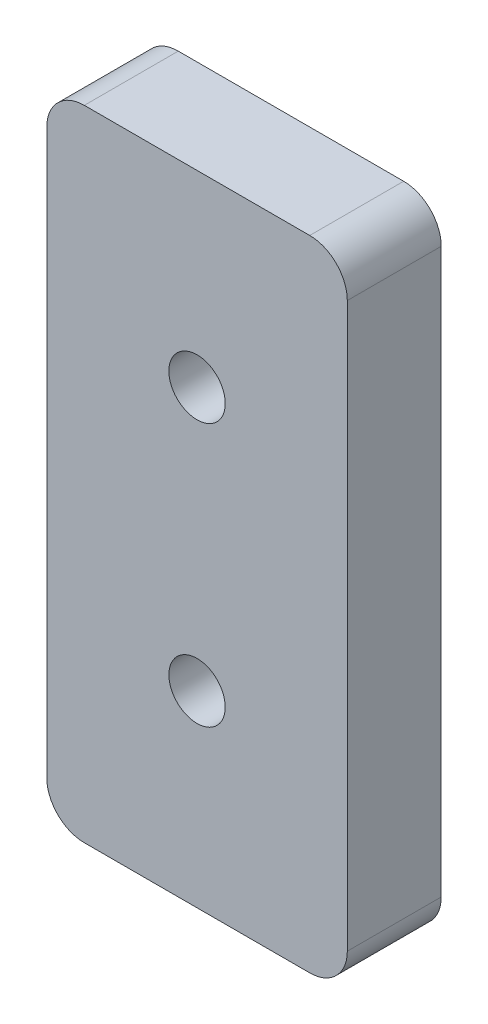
ISO-10303-21;
HEADER;
FILE_DESCRIPTION(('STEP AP214'),'2;1');
FILE_NAME('part.step','',(''),(''),'','','');
FILE_SCHEMA(('AUTOMOTIVE_DESIGN { 1 0 10303 214 1 1 1 1 }'));
ENDSEC;
DATA;
#1=APPLICATION_CONTEXT('core data for automotive mechanical design processes');
#2=APPLICATION_PROTOCOL_DEFINITION('international standard','automotive_design',2000,#1);
#3=PRODUCT_CONTEXT('',#1,'mechanical');
#4=PRODUCT('Part','Part','',(#3));
#5=PRODUCT_RELATED_PRODUCT_CATEGORY('part','',(#4));
#6=PRODUCT_DEFINITION_FORMATION('','',#4);
#7=PRODUCT_DEFINITION_CONTEXT('part definition',#1,'design');
#8=PRODUCT_DEFINITION('design','',#6,#7);
#9=PRODUCT_DEFINITION_SHAPE('','',#8);
#10=(LENGTH_UNIT() NAMED_UNIT(*) SI_UNIT(.MILLI.,.METRE.));
#11=(NAMED_UNIT(*) PLANE_ANGLE_UNIT() SI_UNIT($,.RADIAN.));
#12=(NAMED_UNIT(*) SI_UNIT($,.STERADIAN.) SOLID_ANGLE_UNIT());
#13=UNCERTAINTY_MEASURE_WITH_UNIT(LENGTH_MEASURE(1.E-05),#10,'distance_accuracy_value','');
#14=(GEOMETRIC_REPRESENTATION_CONTEXT(3) GLOBAL_UNCERTAINTY_ASSIGNED_CONTEXT((#13)) GLOBAL_UNIT_ASSIGNED_CONTEXT((#10,
#11,#12)) REPRESENTATION_CONTEXT('',''));
#15=CARTESIAN_POINT('',(0.,0.,0.));
#16=DIRECTION('',(0.,0.,1.));
#17=DIRECTION('',(1.,0.,0.));
#18=AXIS2_PLACEMENT_3D('',#15,#16,#17);
#19=CARTESIAN_POINT('',(0.,0.,5.));
#20=DIRECTION('',(0.,0.,-1.));
#21=DIRECTION('',(-1.,0.,0.));
#22=AXIS2_PLACEMENT_3D('',#19,#20,#21);
#23=PLANE('',#22);
#24=DIRECTION('',(1.,0.,0.));
#25=VECTOR('',#24,1.);
#26=CARTESIAN_POINT('',(-8.,-17.,5.));
#27=LINE('',#26,#25);
#28=CARTESIAN_POINT('',(-6.,-17.,5.));
#29=VERTEX_POINT('',#28);
#30=CARTESIAN_POINT('',(6.,-17.,5.));
#31=VERTEX_POINT('',#30);
#32=EDGE_CURVE('E172',#29,#31,#27,.T.);
#33=ORIENTED_EDGE('',*,*,#32,.T.);
#34=CARTESIAN_POINT('',(6.,-15.,5.));
#35=DIRECTION('',(0.,0.,-1.));
#36=DIRECTION('',(-1.,0.,0.));
#37=AXIS2_PLACEMENT_3D('',#34,#35,#36);
#38=CIRCLE('',#37,2.);
#39=CARTESIAN_POINT('',(8.,-15.,5.));
#40=VERTEX_POINT('',#39);
#41=EDGE_CURVE('E150',#31,#40,#38,.F.);
#42=ORIENTED_EDGE('',*,*,#41,.T.);
#43=DIRECTION('',(0.,1.,0.));
#44=VECTOR('',#43,1.);
#45=CARTESIAN_POINT('',(8.,-17.,5.));
#46=LINE('',#45,#44);
#47=CARTESIAN_POINT('',(8.,15.,5.));
#48=VERTEX_POINT('',#47);
#49=EDGE_CURVE('E120',#40,#48,#46,.T.);
#50=ORIENTED_EDGE('',*,*,#49,.T.);
#51=CARTESIAN_POINT('',(6.,15.,5.));
#52=DIRECTION('',(0.,0.,-1.));
#53=DIRECTION('',(-1.,0.,0.));
#54=AXIS2_PLACEMENT_3D('',#51,#52,#53);
#55=CIRCLE('',#54,2.);
#56=CARTESIAN_POINT('',(6.,17.,5.));
#57=VERTEX_POINT('',#56);
#58=EDGE_CURVE('E56',#48,#57,#55,.F.);
#59=ORIENTED_EDGE('',*,*,#58,.T.);
#60=DIRECTION('',(-1.,0.,0.));
#61=VECTOR('',#60,1.);
#62=CARTESIAN_POINT('',(-8.,17.,5.));
#63=LINE('',#62,#61);
#64=CARTESIAN_POINT('',(-6.,17.,5.));
#65=VERTEX_POINT('',#64);
#66=EDGE_CURVE('E136',#57,#65,#63,.T.);
#67=ORIENTED_EDGE('',*,*,#66,.T.);
#68=CARTESIAN_POINT('',(-6.,15.,5.));
#69=DIRECTION('',(0.,0.,-1.));
#70=DIRECTION('',(-1.,0.,0.));
#71=AXIS2_PLACEMENT_3D('',#68,#69,#70);
#72=CIRCLE('',#71,2.);
#73=CARTESIAN_POINT('',(-8.,15.,5.));
#74=VERTEX_POINT('',#73);
#75=EDGE_CURVE('E146',#65,#74,#72,.F.);
#76=ORIENTED_EDGE('',*,*,#75,.T.);
#77=DIRECTION('',(0.,-1.,0.));
#78=VECTOR('',#77,1.);
#79=CARTESIAN_POINT('',(-8.,-17.,5.));
#80=LINE('',#79,#78);
#81=CARTESIAN_POINT('',(-8.,-15.,5.));
#82=VERTEX_POINT('',#81);
#83=EDGE_CURVE('E130',#74,#82,#80,.T.);
#84=ORIENTED_EDGE('',*,*,#83,.T.);
#85=CARTESIAN_POINT('',(-6.,-15.,5.));
#86=DIRECTION('',(0.,0.,-1.));
#87=DIRECTION('',(-1.,0.,0.));
#88=AXIS2_PLACEMENT_3D('',#85,#86,#87);
#89=CIRCLE('',#88,2.);
#90=EDGE_CURVE('E148',#82,#29,#89,.F.);
#91=ORIENTED_EDGE('',*,*,#90,.T.);
#92=EDGE_LOOP('',(#33,#42,#50,#59,#67,#76,#84,#91));
#93=FACE_BOUND('',#92,.T.);
#94=CARTESIAN_POINT('',(0.,-7.,5.));
#95=DIRECTION('',(0.,0.,1.));
#96=DIRECTION('',(1.,0.,0.));
#97=AXIS2_PLACEMENT_3D('',#94,#95,#96);
#98=CIRCLE('',#97,1.5);
#99=CARTESIAN_POINT('',(1.5,-7.,5.));
#100=VERTEX_POINT('',#99);
#101=EDGE_CURVE('E181',#100,#100,#98,.T.);
#102=ORIENTED_EDGE('',*,*,#101,.F.);
#103=EDGE_LOOP('',(#102));
#104=FACE_BOUND('',#103,.T.);
#105=CARTESIAN_POINT('',(0.,7.,5.));
#106=DIRECTION('',(0.,0.,1.));
#107=DIRECTION('',(1.,0.,0.));
#108=AXIS2_PLACEMENT_3D('',#105,#106,#107);
#109=CIRCLE('',#108,1.5);
#110=CARTESIAN_POINT('',(1.5,7.,5.));
#111=VERTEX_POINT('',#110);
#112=EDGE_CURVE('E186',#111,#111,#109,.T.);
#113=ORIENTED_EDGE('',*,*,#112,.F.);
#114=EDGE_LOOP('',(#113));
#115=FACE_BOUND('',#114,.T.);
#116=ADVANCED_FACE('F36',(#93,#104,#115),#23,.F.);
#117=CARTESIAN_POINT('',(0.,0.,0.));
#118=DIRECTION('',(0.,0.,-1.));
#119=DIRECTION('',(-1.,0.,0.));
#120=AXIS2_PLACEMENT_3D('',#117,#118,#119);
#121=PLANE('',#120);
#122=CARTESIAN_POINT('',(0.,-7.,0.));
#123=DIRECTION('',(0.,0.,1.));
#124=DIRECTION('',(1.,0.,0.));
#125=AXIS2_PLACEMENT_3D('',#122,#123,#124);
#126=CIRCLE('',#125,1.5);
#127=CARTESIAN_POINT('',(1.5,-7.,0.));
#128=VERTEX_POINT('',#127);
#129=EDGE_CURVE('E177',#128,#128,#126,.T.);
#130=ORIENTED_EDGE('',*,*,#129,.T.);
#131=EDGE_LOOP('',(#130));
#132=FACE_BOUND('',#131,.T.);
#133=DIRECTION('',(0.,1.,0.));
#134=VECTOR('',#133,1.);
#135=CARTESIAN_POINT('',(8.,-17.,0.));
#136=LINE('',#135,#134);
#137=CARTESIAN_POINT('',(8.,-15.,0.));
#138=VERTEX_POINT('',#137);
#139=CARTESIAN_POINT('',(8.,15.,0.));
#140=VERTEX_POINT('',#139);
#141=EDGE_CURVE('E118',#138,#140,#136,.T.);
#142=ORIENTED_EDGE('',*,*,#141,.F.);
#143=CARTESIAN_POINT('',(6.,-15.,0.));
#144=DIRECTION('',(0.,0.,-1.));
#145=DIRECTION('',(-1.,0.,0.));
#146=AXIS2_PLACEMENT_3D('',#143,#144,#145);
#147=CIRCLE('',#146,2.);
#148=CARTESIAN_POINT('',(6.,-17.,0.));
#149=VERTEX_POINT('',#148);
#150=EDGE_CURVE('E101',#138,#149,#147,.T.);
#151=ORIENTED_EDGE('',*,*,#150,.T.);
#152=DIRECTION('',(1.,0.,0.));
#153=VECTOR('',#152,1.);
#154=CARTESIAN_POINT('',(-8.,-17.,0.));
#155=LINE('',#154,#153);
#156=CARTESIAN_POINT('',(-6.,-17.,0.));
#157=VERTEX_POINT('',#156);
#158=EDGE_CURVE('E128',#157,#149,#155,.T.);
#159=ORIENTED_EDGE('',*,*,#158,.F.);
#160=CARTESIAN_POINT('',(-6.,-15.,0.));
#161=DIRECTION('',(0.,0.,-1.));
#162=DIRECTION('',(-1.,0.,0.));
#163=AXIS2_PLACEMENT_3D('',#160,#161,#162);
#164=CIRCLE('',#163,2.);
#165=CARTESIAN_POINT('',(-8.,-15.,0.));
#166=VERTEX_POINT('',#165);
#167=EDGE_CURVE('E112',#157,#166,#164,.T.);
#168=ORIENTED_EDGE('',*,*,#167,.T.);
#169=DIRECTION('',(0.,-1.,0.));
#170=VECTOR('',#169,1.);
#171=CARTESIAN_POINT('',(-8.,-17.,0.));
#172=LINE('',#171,#170);
#173=CARTESIAN_POINT('',(-8.,15.,0.));
#174=VERTEX_POINT('',#173);
#175=EDGE_CURVE('E132',#174,#166,#172,.T.);
#176=ORIENTED_EDGE('',*,*,#175,.F.);
#177=CARTESIAN_POINT('',(-6.,15.,0.));
#178=DIRECTION('',(0.,0.,-1.));
#179=DIRECTION('',(-1.,0.,0.));
#180=AXIS2_PLACEMENT_3D('',#177,#178,#179);
#181=CIRCLE('',#180,2.);
#182=CARTESIAN_POINT('',(-6.,17.,0.));
#183=VERTEX_POINT('',#182);
#184=EDGE_CURVE('E139',#174,#183,#181,.T.);
#185=ORIENTED_EDGE('',*,*,#184,.T.);
#186=DIRECTION('',(-1.,0.,0.));
#187=VECTOR('',#186,1.);
#188=CARTESIAN_POINT('',(-8.,17.,0.));
#189=LINE('',#188,#187);
#190=CARTESIAN_POINT('',(6.,17.,0.));
#191=VERTEX_POINT('',#190);
#192=EDGE_CURVE('E127',#191,#183,#189,.T.);
#193=ORIENTED_EDGE('',*,*,#192,.F.);
#194=CARTESIAN_POINT('',(6.,15.,0.));
#195=DIRECTION('',(0.,0.,-1.));
#196=DIRECTION('',(-1.,0.,0.));
#197=AXIS2_PLACEMENT_3D('',#194,#195,#196);
#198=CIRCLE('',#197,2.);
#199=EDGE_CURVE('E121',#191,#140,#198,.T.);
#200=ORIENTED_EDGE('',*,*,#199,.T.);
#201=EDGE_LOOP('',(#142,#151,#159,#168,#176,#185,#193,#200));
#202=FACE_BOUND('',#201,.T.);
#203=CARTESIAN_POINT('',(0.,7.,0.));
#204=DIRECTION('',(0.,0.,1.));
#205=DIRECTION('',(1.,0.,0.));
#206=AXIS2_PLACEMENT_3D('',#203,#204,#205);
#207=CIRCLE('',#206,1.5);
#208=CARTESIAN_POINT('',(1.5,7.,0.));
#209=VERTEX_POINT('',#208);
#210=EDGE_CURVE('E188',#209,#209,#207,.T.);
#211=ORIENTED_EDGE('',*,*,#210,.T.);
#212=EDGE_LOOP('',(#211));
#213=FACE_BOUND('',#212,.T.);
#214=ADVANCED_FACE('F124',(#132,#202,#213),#121,.T.);
#215=CARTESIAN_POINT('',(-8.,-17.,5.));
#216=DIRECTION('',(1.,0.,0.));
#217=DIRECTION('',(0.,1.,0.));
#218=AXIS2_PLACEMENT_3D('',#215,#216,#217);
#219=PLANE('',#218);
#220=ORIENTED_EDGE('',*,*,#175,.T.);
#221=DIRECTION('',(0.,0.,-1.));
#222=VECTOR('',#221,1.);
#223=CARTESIAN_POINT('',(-8.,-15.,5.));
#224=LINE('',#223,#222);
#225=EDGE_CURVE('E155',#166,#82,#224,.F.);
#226=ORIENTED_EDGE('',*,*,#225,.T.);
#227=ORIENTED_EDGE('',*,*,#83,.F.);
#228=DIRECTION('',(0.,0.,-1.));
#229=VECTOR('',#228,1.);
#230=CARTESIAN_POINT('',(-8.,15.,5.));
#231=LINE('',#230,#229);
#232=EDGE_CURVE('E152',#74,#174,#231,.T.);
#233=ORIENTED_EDGE('',*,*,#232,.T.);
#234=EDGE_LOOP('',(#220,#226,#227,#233));
#235=FACE_BOUND('',#234,.T.);
#236=ADVANCED_FACE('F168',(#235),#219,.F.);
#237=CARTESIAN_POINT('',(-8.,-17.,5.));
#238=DIRECTION('',(0.,1.,0.));
#239=DIRECTION('',(0.,0.,1.));
#240=AXIS2_PLACEMENT_3D('',#237,#238,#239);
#241=PLANE('',#240);
#242=ORIENTED_EDGE('',*,*,#158,.T.);
#243=DIRECTION('',(0.,0.,-1.));
#244=VECTOR('',#243,1.);
#245=CARTESIAN_POINT('',(6.,-17.,5.));
#246=LINE('',#245,#244);
#247=EDGE_CURVE('E106',#149,#31,#246,.F.);
#248=ORIENTED_EDGE('',*,*,#247,.T.);
#249=ORIENTED_EDGE('',*,*,#32,.F.);
#250=DIRECTION('',(0.,0.,-1.));
#251=VECTOR('',#250,1.);
#252=CARTESIAN_POINT('',(-6.,-17.,5.));
#253=LINE('',#252,#251);
#254=EDGE_CURVE('E111',#29,#157,#253,.T.);
#255=ORIENTED_EDGE('',*,*,#254,.T.);
#256=EDGE_LOOP('',(#242,#248,#249,#255));
#257=FACE_BOUND('',#256,.T.);
#258=ADVANCED_FACE('F213',(#257),#241,.F.);
#259=CARTESIAN_POINT('',(8.,-17.,5.));
#260=DIRECTION('',(-1.,0.,0.));
#261=DIRECTION('',(0.,0.,1.));
#262=AXIS2_PLACEMENT_3D('',#259,#260,#261);
#263=PLANE('',#262);
#264=ORIENTED_EDGE('',*,*,#49,.F.);
#265=DIRECTION('',(0.,0.,-1.));
#266=VECTOR('',#265,1.);
#267=CARTESIAN_POINT('',(8.,-15.,5.));
#268=LINE('',#267,#266);
#269=EDGE_CURVE('E105',#40,#138,#268,.T.);
#270=ORIENTED_EDGE('',*,*,#269,.T.);
#271=ORIENTED_EDGE('',*,*,#141,.T.);
#272=DIRECTION('',(0.,0.,-1.));
#273=VECTOR('',#272,1.);
#274=CARTESIAN_POINT('',(8.,15.,5.));
#275=LINE('',#274,#273);
#276=EDGE_CURVE('E122',#140,#48,#275,.F.);
#277=ORIENTED_EDGE('',*,*,#276,.T.);
#278=EDGE_LOOP('',(#264,#270,#271,#277));
#279=FACE_BOUND('',#278,.T.);
#280=ADVANCED_FACE('F117',(#279),#263,.F.);
#281=CARTESIAN_POINT('',(-8.,17.,5.));
#282=DIRECTION('',(0.,-1.,0.));
#283=DIRECTION('',(0.,0.,-1.));
#284=AXIS2_PLACEMENT_3D('',#281,#282,#283);
#285=PLANE('',#284);
#286=ORIENTED_EDGE('',*,*,#192,.T.);
#287=DIRECTION('',(0.,0.,-1.));
#288=VECTOR('',#287,1.);
#289=CARTESIAN_POINT('',(-6.,17.,5.));
#290=LINE('',#289,#288);
#291=EDGE_CURVE('E11',#183,#65,#290,.F.);
#292=ORIENTED_EDGE('',*,*,#291,.T.);
#293=ORIENTED_EDGE('',*,*,#66,.F.);
#294=DIRECTION('',(0.,0.,-1.));
#295=VECTOR('',#294,1.);
#296=CARTESIAN_POINT('',(6.,17.,5.));
#297=LINE('',#296,#295);
#298=EDGE_CURVE('E44',#57,#191,#297,.T.);
#299=ORIENTED_EDGE('',*,*,#298,.T.);
#300=EDGE_LOOP('',(#286,#292,#293,#299));
#301=FACE_BOUND('',#300,.T.);
#302=ADVANCED_FACE('F158',(#301),#285,.F.);
#303=CARTESIAN_POINT('',(0.,-7.,5.));
#304=DIRECTION('',(0.,0.,-1.));
#305=DIRECTION('',(-1.,0.,0.));
#306=AXIS2_PLACEMENT_3D('',#303,#304,#305);
#307=CYLINDRICAL_SURFACE('',#306,1.5);
#308=ORIENTED_EDGE('',*,*,#101,.T.);
#309=EDGE_LOOP('',(#308));
#310=FACE_BOUND('',#309,.T.);
#311=ORIENTED_EDGE('',*,*,#129,.F.);
#312=EDGE_LOOP('',(#311));
#313=FACE_BOUND('',#312,.T.);
#314=ADVANCED_FACE('F206',(#310,#313),#307,.F.);
#315=CARTESIAN_POINT('',(0.,7.,5.));
#316=DIRECTION('',(0.,0.,-1.));
#317=DIRECTION('',(-1.,0.,0.));
#318=AXIS2_PLACEMENT_3D('',#315,#316,#317);
#319=CYLINDRICAL_SURFACE('',#318,1.5);
#320=ORIENTED_EDGE('',*,*,#112,.T.);
#321=EDGE_LOOP('',(#320));
#322=FACE_BOUND('',#321,.T.);
#323=ORIENTED_EDGE('',*,*,#210,.F.);
#324=EDGE_LOOP('',(#323));
#325=FACE_BOUND('',#324,.T.);
#326=ADVANCED_FACE('F194',(#322,#325),#319,.F.);
#327=CARTESIAN_POINT('',(6.,-15.,5.));
#328=DIRECTION('',(0.,0.,-1.));
#329=DIRECTION('',(-1.,0.,0.));
#330=AXIS2_PLACEMENT_3D('',#327,#328,#329);
#331=CYLINDRICAL_SURFACE('',#330,2.);
#332=ORIENTED_EDGE('',*,*,#41,.F.);
#333=ORIENTED_EDGE('',*,*,#247,.F.);
#334=ORIENTED_EDGE('',*,*,#150,.F.);
#335=ORIENTED_EDGE('',*,*,#269,.F.);
#336=EDGE_LOOP('',(#332,#333,#334,#335));
#337=FACE_BOUND('',#336,.T.);
#338=ADVANCED_FACE('F104',(#337),#331,.T.);
#339=CARTESIAN_POINT('',(-6.,-15.,5.));
#340=DIRECTION('',(0.,0.,-1.));
#341=DIRECTION('',(-1.,0.,0.));
#342=AXIS2_PLACEMENT_3D('',#339,#340,#341);
#343=CYLINDRICAL_SURFACE('',#342,2.);
#344=ORIENTED_EDGE('',*,*,#90,.F.);
#345=ORIENTED_EDGE('',*,*,#225,.F.);
#346=ORIENTED_EDGE('',*,*,#167,.F.);
#347=ORIENTED_EDGE('',*,*,#254,.F.);
#348=EDGE_LOOP('',(#344,#345,#346,#347));
#349=FACE_BOUND('',#348,.T.);
#350=ADVANCED_FACE('F221',(#349),#343,.T.);
#351=CARTESIAN_POINT('',(-6.,15.,5.));
#352=DIRECTION('',(0.,0.,-1.));
#353=DIRECTION('',(-1.,0.,0.));
#354=AXIS2_PLACEMENT_3D('',#351,#352,#353);
#355=CYLINDRICAL_SURFACE('',#354,2.);
#356=ORIENTED_EDGE('',*,*,#75,.F.);
#357=ORIENTED_EDGE('',*,*,#291,.F.);
#358=ORIENTED_EDGE('',*,*,#184,.F.);
#359=ORIENTED_EDGE('',*,*,#232,.F.);
#360=EDGE_LOOP('',(#356,#357,#358,#359));
#361=FACE_BOUND('',#360,.T.);
#362=ADVANCED_FACE('F165',(#361),#355,.T.);
#363=CARTESIAN_POINT('',(6.,15.,5.));
#364=DIRECTION('',(0.,0.,-1.));
#365=DIRECTION('',(-1.,0.,0.));
#366=AXIS2_PLACEMENT_3D('',#363,#364,#365);
#367=CYLINDRICAL_SURFACE('',#366,2.);
#368=ORIENTED_EDGE('',*,*,#58,.F.);
#369=ORIENTED_EDGE('',*,*,#276,.F.);
#370=ORIENTED_EDGE('',*,*,#199,.F.);
#371=ORIENTED_EDGE('',*,*,#298,.F.);
#372=EDGE_LOOP('',(#368,#369,#370,#371));
#373=FACE_BOUND('',#372,.T.);
#374=ADVANCED_FACE('F38',(#373),#367,.T.);
#375=CLOSED_SHELL('',(#116,#214,#236,#258,#280,#302,#314,#326,#338,#350,#362,#374));
#376=MANIFOLD_SOLID_BREP('B2',#375);
#377=ADVANCED_BREP_SHAPE_REPRESENTATION('',(#18,#376),#14);
#378=SHAPE_DEFINITION_REPRESENTATION(#9,#377);
ENDSEC;
END-ISO-10303-21;
